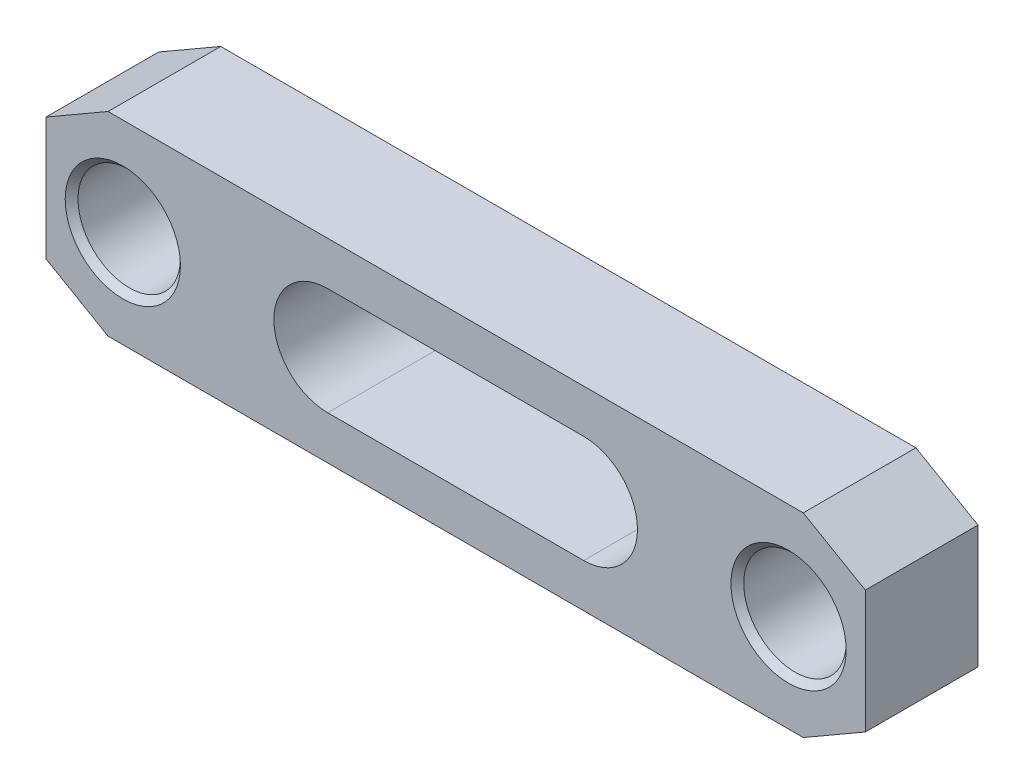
ISO-10303-21;
HEADER;
FILE_DESCRIPTION(('STEP AP214'),'2;1');
FILE_NAME('part.step','',(''),(''),'','','');
FILE_SCHEMA(('AUTOMOTIVE_DESIGN { 1 0 10303 214 1 1 1 1 }'));
ENDSEC;
DATA;
#1=APPLICATION_CONTEXT('core data for automotive mechanical design processes');
#2=APPLICATION_PROTOCOL_DEFINITION('international standard','automotive_design',2000,#1);
#3=PRODUCT_CONTEXT('',#1,'mechanical');
#4=PRODUCT('Part','Part','',(#3));
#5=PRODUCT_RELATED_PRODUCT_CATEGORY('part','',(#4));
#6=PRODUCT_DEFINITION_FORMATION('','',#4);
#7=PRODUCT_DEFINITION_CONTEXT('part definition',#1,'design');
#8=PRODUCT_DEFINITION('design','',#6,#7);
#9=PRODUCT_DEFINITION_SHAPE('','',#8);
#10=(LENGTH_UNIT() NAMED_UNIT(*) SI_UNIT(.MILLI.,.METRE.));
#11=(NAMED_UNIT(*) PLANE_ANGLE_UNIT() SI_UNIT($,.RADIAN.));
#12=(NAMED_UNIT(*) SI_UNIT($,.STERADIAN.) SOLID_ANGLE_UNIT());
#13=UNCERTAINTY_MEASURE_WITH_UNIT(LENGTH_MEASURE(1.E-05),#10,'distance_accuracy_value','');
#14=(GEOMETRIC_REPRESENTATION_CONTEXT(3) GLOBAL_UNCERTAINTY_ASSIGNED_CONTEXT((#13)) GLOBAL_UNIT_ASSIGNED_CONTEXT((#10,
#11,#12)) REPRESENTATION_CONTEXT('',''));
#15=CARTESIAN_POINT('',(0.,0.,0.));
#16=DIRECTION('',(0.,0.,1.));
#17=DIRECTION('',(1.,0.,0.));
#18=AXIS2_PLACEMENT_3D('',#15,#16,#17);
#19=CARTESIAN_POINT('',(80.,-19.,22.));
#20=DIRECTION('',(0.,0.,1.));
#21=DIRECTION('',(1.,0.,0.));
#22=AXIS2_PLACEMENT_3D('',#19,#20,#21);
#23=PLANE('',#22);
#24=CARTESIAN_POINT('',(65.,0.,22.));
#25=DIRECTION('',(0.,0.,-1.));
#26=DIRECTION('',(-1.,0.,0.));
#27=AXIS2_PLACEMENT_3D('',#24,#25,#26);
#28=CIRCLE('',#27,11.25);
#29=CARTESIAN_POINT('',(53.75,0.,22.));
#30=VERTEX_POINT('',#29);
#31=EDGE_CURVE('E212',#30,#30,#28,.T.);
#32=ORIENTED_EDGE('',*,*,#31,.T.);
#33=EDGE_LOOP('',(#32));
#34=FACE_BOUND('',#33,.T.);
#35=CARTESIAN_POINT('',(-65.,0.,22.));
#36=DIRECTION('',(0.,0.,-1.));
#37=DIRECTION('',(-1.,0.,0.));
#38=AXIS2_PLACEMENT_3D('',#35,#36,#37);
#39=CIRCLE('',#38,11.25);
#40=CARTESIAN_POINT('',(-76.25,0.,22.));
#41=VERTEX_POINT('',#40);
#42=EDGE_CURVE('E133',#41,#41,#39,.T.);
#43=ORIENTED_EDGE('',*,*,#42,.T.);
#44=EDGE_LOOP('',(#43));
#45=FACE_BOUND('',#44,.T.);
#46=DIRECTION('',(1.,0.,0.));
#47=VECTOR('',#46,1.);
#48=CARTESIAN_POINT('',(-67.875644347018,-19.,22.));
#49=LINE('',#48,#47);
#50=CARTESIAN_POINT('',(-67.875644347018,-19.,22.));
#51=VERTEX_POINT('',#50);
#52=CARTESIAN_POINT('',(67.875644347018,-19.,22.));
#53=VERTEX_POINT('',#52);
#54=EDGE_CURVE('E143',#51,#53,#49,.T.);
#55=ORIENTED_EDGE('',*,*,#54,.T.);
#56=DIRECTION('',(0.866025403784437,0.5,0.));
#57=VECTOR('',#56,1.);
#58=CARTESIAN_POINT('',(67.875644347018,-19.,22.));
#59=LINE('',#58,#57);
#60=CARTESIAN_POINT('',(80.,-12.,22.));
#61=VERTEX_POINT('',#60);
#62=EDGE_CURVE('E146',#53,#61,#59,.T.);
#63=ORIENTED_EDGE('',*,*,#62,.T.);
#64=DIRECTION('',(0.,1.,0.));
#65=VECTOR('',#64,1.);
#66=CARTESIAN_POINT('',(80.,-12.,22.));
#67=LINE('',#66,#65);
#68=CARTESIAN_POINT('',(80.,12.,22.));
#69=VERTEX_POINT('',#68);
#70=EDGE_CURVE('E149',#61,#69,#67,.T.);
#71=ORIENTED_EDGE('',*,*,#70,.T.);
#72=DIRECTION('',(-0.866025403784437,0.5,0.));
#73=VECTOR('',#72,1.);
#74=CARTESIAN_POINT('',(67.875644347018,19.,22.));
#75=LINE('',#74,#73);
#76=CARTESIAN_POINT('',(67.875644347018,19.,22.));
#77=VERTEX_POINT('',#76);
#78=EDGE_CURVE('E151',#69,#77,#75,.T.);
#79=ORIENTED_EDGE('',*,*,#78,.T.);
#80=DIRECTION('',(-1.,0.,0.));
#81=VECTOR('',#80,1.);
#82=CARTESIAN_POINT('',(-67.875644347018,19.,22.));
#83=LINE('',#82,#81);
#84=CARTESIAN_POINT('',(-67.875644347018,19.,22.));
#85=VERTEX_POINT('',#84);
#86=EDGE_CURVE('E153',#77,#85,#83,.T.);
#87=ORIENTED_EDGE('',*,*,#86,.T.);
#88=DIRECTION('',(-0.866025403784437,-0.5,0.));
#89=VECTOR('',#88,1.);
#90=CARTESIAN_POINT('',(-67.875644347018,19.,22.));
#91=LINE('',#90,#89);
#92=CARTESIAN_POINT('',(-80.,12.,22.));
#93=VERTEX_POINT('',#92);
#94=EDGE_CURVE('E155',#85,#93,#91,.T.);
#95=ORIENTED_EDGE('',*,*,#94,.T.);
#96=DIRECTION('',(0.,-1.,0.));
#97=VECTOR('',#96,1.);
#98=CARTESIAN_POINT('',(-80.,-12.,22.));
#99=LINE('',#98,#97);
#100=CARTESIAN_POINT('',(-80.,-12.,22.));
#101=VERTEX_POINT('',#100);
#102=EDGE_CURVE('E157',#93,#101,#99,.T.);
#103=ORIENTED_EDGE('',*,*,#102,.T.);
#104=DIRECTION('',(0.866025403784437,-0.5,0.));
#105=VECTOR('',#104,1.);
#106=CARTESIAN_POINT('',(-67.875644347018,-19.,22.));
#107=LINE('',#106,#105);
#108=EDGE_CURVE('E159',#101,#51,#107,.T.);
#109=ORIENTED_EDGE('',*,*,#108,.T.);
#110=EDGE_LOOP('',(#55,#63,#71,#79,#87,#95,#103,#109));
#111=FACE_BOUND('',#110,.T.);
#112=DIRECTION('',(-1.,0.,0.));
#113=VECTOR('',#112,1.);
#114=CARTESIAN_POINT('',(25.,10.5,22.));
#115=LINE('',#114,#113);
#116=CARTESIAN_POINT('',(25.,10.5,22.));
#117=VERTEX_POINT('',#116);
#118=CARTESIAN_POINT('',(-25.,10.5,22.));
#119=VERTEX_POINT('',#118);
#120=EDGE_CURVE('E113',#117,#119,#115,.T.);
#121=ORIENTED_EDGE('',*,*,#120,.F.);
#122=CARTESIAN_POINT('',(25.,0.,22.));
#123=DIRECTION('',(0.,0.,1.));
#124=DIRECTION('',(1.,0.,0.));
#125=AXIS2_PLACEMENT_3D('',#122,#123,#124);
#126=CIRCLE('',#125,10.5);
#127=CARTESIAN_POINT('',(25.,-10.5,22.));
#128=VERTEX_POINT('',#127);
#129=EDGE_CURVE('E105',#128,#117,#126,.T.);
#130=ORIENTED_EDGE('',*,*,#129,.F.);
#131=DIRECTION('',(1.,0.,0.));
#132=VECTOR('',#131,1.);
#133=CARTESIAN_POINT('',(25.,-10.5,22.));
#134=LINE('',#133,#132);
#135=CARTESIAN_POINT('',(-25.,-10.5,22.));
#136=VERTEX_POINT('',#135);
#137=EDGE_CURVE('E127',#136,#128,#134,.T.);
#138=ORIENTED_EDGE('',*,*,#137,.F.);
#139=CARTESIAN_POINT('',(-25.,0.,22.));
#140=DIRECTION('',(0.,0.,1.));
#141=DIRECTION('',(1.,0.,0.));
#142=AXIS2_PLACEMENT_3D('',#139,#140,#141);
#143=CIRCLE('',#142,10.5);
#144=EDGE_CURVE('E125',#119,#136,#143,.T.);
#145=ORIENTED_EDGE('',*,*,#144,.F.);
#146=EDGE_LOOP('',(#121,#130,#138,#145));
#147=FACE_BOUND('',#146,.T.);
#148=ADVANCED_FACE('F14',(#34,#45,#111,#147),#23,.T.);
#149=CARTESIAN_POINT('',(80.,-19.,0.));
#150=DIRECTION('',(0.,0.,1.));
#151=DIRECTION('',(1.,0.,0.));
#152=AXIS2_PLACEMENT_3D('',#149,#150,#151);
#153=PLANE('',#152);
#154=CARTESIAN_POINT('',(65.,0.,0.));
#155=DIRECTION('',(0.,0.,-1.));
#156=DIRECTION('',(-1.,0.,0.));
#157=AXIS2_PLACEMENT_3D('',#154,#155,#156);
#158=CIRCLE('',#157,11.25);
#159=CARTESIAN_POINT('',(53.75,0.,0.));
#160=VERTEX_POINT('',#159);
#161=EDGE_CURVE('E202',#160,#160,#158,.T.);
#162=ORIENTED_EDGE('',*,*,#161,.F.);
#163=EDGE_LOOP('',(#162));
#164=FACE_BOUND('',#163,.T.);
#165=CARTESIAN_POINT('',(-65.,0.,0.));
#166=DIRECTION('',(0.,0.,-1.));
#167=DIRECTION('',(-1.,0.,0.));
#168=AXIS2_PLACEMENT_3D('',#165,#166,#167);
#169=CIRCLE('',#168,11.25);
#170=CARTESIAN_POINT('',(-76.25,0.,0.));
#171=VERTEX_POINT('',#170);
#172=EDGE_CURVE('E215',#171,#171,#169,.T.);
#173=ORIENTED_EDGE('',*,*,#172,.F.);
#174=EDGE_LOOP('',(#173));
#175=FACE_BOUND('',#174,.T.);
#176=DIRECTION('',(1.,0.,0.));
#177=VECTOR('',#176,1.);
#178=CARTESIAN_POINT('',(-67.875644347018,-19.,0.));
#179=LINE('',#178,#177);
#180=CARTESIAN_POINT('',(-67.875644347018,-19.,0.));
#181=VERTEX_POINT('',#180);
#182=CARTESIAN_POINT('',(67.875644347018,-19.,0.));
#183=VERTEX_POINT('',#182);
#184=EDGE_CURVE('E121',#181,#183,#179,.T.);
#185=ORIENTED_EDGE('',*,*,#184,.F.);
#186=DIRECTION('',(0.866025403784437,-0.5,0.));
#187=VECTOR('',#186,1.);
#188=CARTESIAN_POINT('',(-67.875644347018,-19.,0.));
#189=LINE('',#188,#187);
#190=CARTESIAN_POINT('',(-80.,-12.,0.));
#191=VERTEX_POINT('',#190);
#192=EDGE_CURVE('E147',#191,#181,#189,.T.);
#193=ORIENTED_EDGE('',*,*,#192,.F.);
#194=DIRECTION('',(0.,-1.,0.));
#195=VECTOR('',#194,1.);
#196=CARTESIAN_POINT('',(-80.,-12.,0.));
#197=LINE('',#196,#195);
#198=CARTESIAN_POINT('',(-80.,12.,0.));
#199=VERTEX_POINT('',#198);
#200=EDGE_CURVE('E174',#199,#191,#197,.T.);
#201=ORIENTED_EDGE('',*,*,#200,.F.);
#202=DIRECTION('',(-0.866025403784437,-0.5,0.));
#203=VECTOR('',#202,1.);
#204=CARTESIAN_POINT('',(-67.875644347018,19.,0.));
#205=LINE('',#204,#203);
#206=CARTESIAN_POINT('',(-67.875644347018,19.,0.));
#207=VERTEX_POINT('',#206);
#208=EDGE_CURVE('E172',#207,#199,#205,.T.);
#209=ORIENTED_EDGE('',*,*,#208,.F.);
#210=DIRECTION('',(-1.,0.,0.));
#211=VECTOR('',#210,1.);
#212=CARTESIAN_POINT('',(-67.875644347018,19.,0.));
#213=LINE('',#212,#211);
#214=CARTESIAN_POINT('',(67.875644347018,19.,0.));
#215=VERTEX_POINT('',#214);
#216=EDGE_CURVE('E170',#215,#207,#213,.T.);
#217=ORIENTED_EDGE('',*,*,#216,.F.);
#218=DIRECTION('',(-0.866025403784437,0.5,0.));
#219=VECTOR('',#218,1.);
#220=CARTESIAN_POINT('',(67.875644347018,19.,0.));
#221=LINE('',#220,#219);
#222=CARTESIAN_POINT('',(80.,12.,0.));
#223=VERTEX_POINT('',#222);
#224=EDGE_CURVE('E168',#223,#215,#221,.T.);
#225=ORIENTED_EDGE('',*,*,#224,.F.);
#226=DIRECTION('',(0.,1.,0.));
#227=VECTOR('',#226,1.);
#228=CARTESIAN_POINT('',(80.,-12.,0.));
#229=LINE('',#228,#227);
#230=CARTESIAN_POINT('',(80.,-12.,0.));
#231=VERTEX_POINT('',#230);
#232=EDGE_CURVE('E166',#231,#223,#229,.T.);
#233=ORIENTED_EDGE('',*,*,#232,.F.);
#234=DIRECTION('',(0.866025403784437,0.5,0.));
#235=VECTOR('',#234,1.);
#236=CARTESIAN_POINT('',(67.875644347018,-19.,0.));
#237=LINE('',#236,#235);
#238=EDGE_CURVE('E164',#183,#231,#237,.T.);
#239=ORIENTED_EDGE('',*,*,#238,.F.);
#240=EDGE_LOOP('',(#185,#193,#201,#209,#217,#225,#233,#239));
#241=FACE_BOUND('',#240,.T.);
#242=CARTESIAN_POINT('',(25.,0.,0.));
#243=DIRECTION('',(0.,0.,1.));
#244=DIRECTION('',(1.,0.,0.));
#245=AXIS2_PLACEMENT_3D('',#242,#243,#244);
#246=CIRCLE('',#245,10.5);
#247=CARTESIAN_POINT('',(25.,-10.5,0.));
#248=VERTEX_POINT('',#247);
#249=CARTESIAN_POINT('',(25.,10.5,0.));
#250=VERTEX_POINT('',#249);
#251=EDGE_CURVE('E39',#248,#250,#246,.T.);
#252=ORIENTED_EDGE('',*,*,#251,.T.);
#253=DIRECTION('',(-1.,0.,0.));
#254=VECTOR('',#253,1.);
#255=CARTESIAN_POINT('',(25.,10.5,0.));
#256=LINE('',#255,#254);
#257=CARTESIAN_POINT('',(-25.,10.5,0.));
#258=VERTEX_POINT('',#257);
#259=EDGE_CURVE('E120',#250,#258,#256,.T.);
#260=ORIENTED_EDGE('',*,*,#259,.T.);
#261=CARTESIAN_POINT('',(-25.,0.,0.));
#262=DIRECTION('',(0.,0.,1.));
#263=DIRECTION('',(1.,0.,0.));
#264=AXIS2_PLACEMENT_3D('',#261,#262,#263);
#265=CIRCLE('',#264,10.5);
#266=CARTESIAN_POINT('',(-25.,-10.5,0.));
#267=VERTEX_POINT('',#266);
#268=EDGE_CURVE('E135',#258,#267,#265,.T.);
#269=ORIENTED_EDGE('',*,*,#268,.T.);
#270=DIRECTION('',(1.,0.,0.));
#271=VECTOR('',#270,1.);
#272=CARTESIAN_POINT('',(25.,-10.5,0.));
#273=LINE('',#272,#271);
#274=EDGE_CURVE('E114',#267,#248,#273,.T.);
#275=ORIENTED_EDGE('',*,*,#274,.T.);
#276=EDGE_LOOP('',(#252,#260,#269,#275));
#277=FACE_BOUND('',#276,.T.);
#278=ADVANCED_FACE('F238',(#164,#175,#241,#277),#153,.F.);
#279=CARTESIAN_POINT('',(-67.875644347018,-19.,22.));
#280=DIRECTION('',(0.,1.,0.));
#281=DIRECTION('',(-1.,0.,0.));
#282=AXIS2_PLACEMENT_3D('',#279,#280,#281);
#283=PLANE('',#282);
#284=ORIENTED_EDGE('',*,*,#184,.T.);
#285=DIRECTION('',(0.,0.,-1.));
#286=VECTOR('',#285,1.);
#287=CARTESIAN_POINT('',(67.875644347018,-19.,22.));
#288=LINE('',#287,#286);
#289=EDGE_CURVE('E9',#53,#183,#288,.T.);
#290=ORIENTED_EDGE('',*,*,#289,.F.);
#291=ORIENTED_EDGE('',*,*,#54,.F.);
#292=DIRECTION('',(0.,0.,-1.));
#293=VECTOR('',#292,1.);
#294=CARTESIAN_POINT('',(-67.875644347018,-19.,22.));
#295=LINE('',#294,#293);
#296=EDGE_CURVE('E161',#51,#181,#295,.T.);
#297=ORIENTED_EDGE('',*,*,#296,.T.);
#298=EDGE_LOOP('',(#284,#290,#291,#297));
#299=FACE_BOUND('',#298,.T.);
#300=ADVANCED_FACE('F16',(#299),#283,.F.);
#301=CARTESIAN_POINT('',(67.875644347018,-19.,22.));
#302=DIRECTION('',(-0.5,0.866025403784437,0.));
#303=DIRECTION('',(-0.866025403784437,-0.5,0.));
#304=AXIS2_PLACEMENT_3D('',#301,#302,#303);
#305=PLANE('',#304);
#306=ORIENTED_EDGE('',*,*,#238,.T.);
#307=DIRECTION('',(0.,0.,-1.));
#308=VECTOR('',#307,1.);
#309=CARTESIAN_POINT('',(80.,-12.,22.));
#310=LINE('',#309,#308);
#311=EDGE_CURVE('E23',#61,#231,#310,.T.);
#312=ORIENTED_EDGE('',*,*,#311,.F.);
#313=ORIENTED_EDGE('',*,*,#62,.F.);
#314=ORIENTED_EDGE('',*,*,#289,.T.);
#315=EDGE_LOOP('',(#306,#312,#313,#314));
#316=FACE_BOUND('',#315,.T.);
#317=ADVANCED_FACE('F271',(#316),#305,.F.);
#318=CARTESIAN_POINT('',(80.,-12.,22.));
#319=DIRECTION('',(-1.,0.,0.));
#320=DIRECTION('',(0.,0.,1.));
#321=AXIS2_PLACEMENT_3D('',#318,#319,#320);
#322=PLANE('',#321);
#323=ORIENTED_EDGE('',*,*,#232,.T.);
#324=DIRECTION('',(0.,0.,-1.));
#325=VECTOR('',#324,1.);
#326=CARTESIAN_POINT('',(80.,12.,22.));
#327=LINE('',#326,#325);
#328=EDGE_CURVE('E191',#69,#223,#327,.T.);
#329=ORIENTED_EDGE('',*,*,#328,.F.);
#330=ORIENTED_EDGE('',*,*,#70,.F.);
#331=ORIENTED_EDGE('',*,*,#311,.T.);
#332=EDGE_LOOP('',(#323,#329,#330,#331));
#333=FACE_BOUND('',#332,.T.);
#334=ADVANCED_FACE('F268',(#333),#322,.F.);
#335=CARTESIAN_POINT('',(67.875644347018,19.,22.));
#336=DIRECTION('',(-0.5,-0.866025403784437,0.));
#337=DIRECTION('',(0.866025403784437,-0.5,0.));
#338=AXIS2_PLACEMENT_3D('',#335,#336,#337);
#339=PLANE('',#338);
#340=ORIENTED_EDGE('',*,*,#224,.T.);
#341=DIRECTION('',(0.,0.,-1.));
#342=VECTOR('',#341,1.);
#343=CARTESIAN_POINT('',(67.875644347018,19.,22.));
#344=LINE('',#343,#342);
#345=EDGE_CURVE('E188',#77,#215,#344,.T.);
#346=ORIENTED_EDGE('',*,*,#345,.F.);
#347=ORIENTED_EDGE('',*,*,#78,.F.);
#348=ORIENTED_EDGE('',*,*,#328,.T.);
#349=EDGE_LOOP('',(#340,#346,#347,#348));
#350=FACE_BOUND('',#349,.T.);
#351=ADVANCED_FACE('F264',(#350),#339,.F.);
#352=CARTESIAN_POINT('',(-67.875644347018,19.,22.));
#353=DIRECTION('',(0.,-1.,0.));
#354=DIRECTION('',(0.,0.,-1.));
#355=AXIS2_PLACEMENT_3D('',#352,#353,#354);
#356=PLANE('',#355);
#357=ORIENTED_EDGE('',*,*,#216,.T.);
#358=DIRECTION('',(0.,0.,-1.));
#359=VECTOR('',#358,1.);
#360=CARTESIAN_POINT('',(-67.875644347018,19.,22.));
#361=LINE('',#360,#359);
#362=EDGE_CURVE('E185',#85,#207,#361,.T.);
#363=ORIENTED_EDGE('',*,*,#362,.F.);
#364=ORIENTED_EDGE('',*,*,#86,.F.);
#365=ORIENTED_EDGE('',*,*,#345,.T.);
#366=EDGE_LOOP('',(#357,#363,#364,#365));
#367=FACE_BOUND('',#366,.T.);
#368=ADVANCED_FACE('F260',(#367),#356,.F.);
#369=CARTESIAN_POINT('',(-67.875644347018,19.,22.));
#370=DIRECTION('',(0.5,-0.866025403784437,0.));
#371=DIRECTION('',(0.866025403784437,0.5,0.));
#372=AXIS2_PLACEMENT_3D('',#369,#370,#371);
#373=PLANE('',#372);
#374=ORIENTED_EDGE('',*,*,#208,.T.);
#375=DIRECTION('',(0.,0.,-1.));
#376=VECTOR('',#375,1.);
#377=CARTESIAN_POINT('',(-80.,12.,22.));
#378=LINE('',#377,#376);
#379=EDGE_CURVE('E182',#93,#199,#378,.T.);
#380=ORIENTED_EDGE('',*,*,#379,.F.);
#381=ORIENTED_EDGE('',*,*,#94,.F.);
#382=ORIENTED_EDGE('',*,*,#362,.T.);
#383=EDGE_LOOP('',(#374,#380,#381,#382));
#384=FACE_BOUND('',#383,.T.);
#385=ADVANCED_FACE('F256',(#384),#373,.F.);
#386=CARTESIAN_POINT('',(-80.,-12.,22.));
#387=DIRECTION('',(1.,0.,0.));
#388=DIRECTION('',(0.,0.,-1.));
#389=AXIS2_PLACEMENT_3D('',#386,#387,#388);
#390=PLANE('',#389);
#391=ORIENTED_EDGE('',*,*,#200,.T.);
#392=DIRECTION('',(0.,0.,-1.));
#393=VECTOR('',#392,1.);
#394=CARTESIAN_POINT('',(-80.,-12.,22.));
#395=LINE('',#394,#393);
#396=EDGE_CURVE('E179',#101,#191,#395,.T.);
#397=ORIENTED_EDGE('',*,*,#396,.F.);
#398=ORIENTED_EDGE('',*,*,#102,.F.);
#399=ORIENTED_EDGE('',*,*,#379,.T.);
#400=EDGE_LOOP('',(#391,#397,#398,#399));
#401=FACE_BOUND('',#400,.T.);
#402=ADVANCED_FACE('F252',(#401),#390,.F.);
#403=CARTESIAN_POINT('',(-67.875644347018,-19.,22.));
#404=DIRECTION('',(0.5,0.866025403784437,0.));
#405=DIRECTION('',(-0.866025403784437,0.5,0.));
#406=AXIS2_PLACEMENT_3D('',#403,#404,#405);
#407=PLANE('',#406);
#408=ORIENTED_EDGE('',*,*,#192,.T.);
#409=ORIENTED_EDGE('',*,*,#296,.F.);
#410=ORIENTED_EDGE('',*,*,#108,.F.);
#411=ORIENTED_EDGE('',*,*,#396,.T.);
#412=EDGE_LOOP('',(#408,#409,#410,#411));
#413=FACE_BOUND('',#412,.T.);
#414=ADVANCED_FACE('F249',(#413),#407,.F.);
#415=CARTESIAN_POINT('',(25.,0.,22.));
#416=DIRECTION('',(0.,0.,-1.));
#417=DIRECTION('',(-1.,0.,0.));
#418=AXIS2_PLACEMENT_3D('',#415,#416,#417);
#419=CYLINDRICAL_SURFACE('',#418,10.5);
#420=ORIENTED_EDGE('',*,*,#251,.F.);
#421=DIRECTION('',(0.,0.,-1.));
#422=VECTOR('',#421,1.);
#423=CARTESIAN_POINT('',(25.,-10.5,22.));
#424=LINE('',#423,#422);
#425=EDGE_CURVE('E109',#128,#248,#424,.T.);
#426=ORIENTED_EDGE('',*,*,#425,.F.);
#427=ORIENTED_EDGE('',*,*,#129,.T.);
#428=DIRECTION('',(0.,0.,-1.));
#429=VECTOR('',#428,1.);
#430=CARTESIAN_POINT('',(25.,10.5,22.));
#431=LINE('',#430,#429);
#432=EDGE_CURVE('E108',#117,#250,#431,.T.);
#433=ORIENTED_EDGE('',*,*,#432,.T.);
#434=EDGE_LOOP('',(#420,#426,#427,#433));
#435=FACE_BOUND('',#434,.T.);
#436=ADVANCED_FACE('F107',(#435),#419,.F.);
#437=CARTESIAN_POINT('',(25.,10.5,22.));
#438=DIRECTION('',(0.,-1.,0.));
#439=DIRECTION('',(1.,0.,0.));
#440=AXIS2_PLACEMENT_3D('',#437,#438,#439);
#441=PLANE('',#440);
#442=ORIENTED_EDGE('',*,*,#259,.F.);
#443=ORIENTED_EDGE('',*,*,#432,.F.);
#444=ORIENTED_EDGE('',*,*,#120,.T.);
#445=DIRECTION('',(0.,0.,-1.));
#446=VECTOR('',#445,1.);
#447=CARTESIAN_POINT('',(-25.,10.5,22.));
#448=LINE('',#447,#446);
#449=EDGE_CURVE('E122',#119,#258,#448,.T.);
#450=ORIENTED_EDGE('',*,*,#449,.T.);
#451=EDGE_LOOP('',(#442,#443,#444,#450));
#452=FACE_BOUND('',#451,.T.);
#453=ADVANCED_FACE('F117',(#452),#441,.T.);
#454=CARTESIAN_POINT('',(-25.,0.,22.));
#455=DIRECTION('',(0.,0.,-1.));
#456=DIRECTION('',(-1.,0.,0.));
#457=AXIS2_PLACEMENT_3D('',#454,#455,#456);
#458=CYLINDRICAL_SURFACE('',#457,10.5);
#459=ORIENTED_EDGE('',*,*,#268,.F.);
#460=ORIENTED_EDGE('',*,*,#449,.F.);
#461=ORIENTED_EDGE('',*,*,#144,.T.);
#462=DIRECTION('',(0.,0.,-1.));
#463=VECTOR('',#462,1.);
#464=CARTESIAN_POINT('',(-25.,-10.5,22.));
#465=LINE('',#464,#463);
#466=EDGE_CURVE('E31',#136,#267,#465,.T.);
#467=ORIENTED_EDGE('',*,*,#466,.T.);
#468=EDGE_LOOP('',(#459,#460,#461,#467));
#469=FACE_BOUND('',#468,.T.);
#470=ADVANCED_FACE('F235',(#469),#458,.F.);
#471=CARTESIAN_POINT('',(25.,-10.5,22.));
#472=DIRECTION('',(0.,1.,0.));
#473=DIRECTION('',(-1.,0.,0.));
#474=AXIS2_PLACEMENT_3D('',#471,#472,#473);
#475=PLANE('',#474);
#476=ORIENTED_EDGE('',*,*,#274,.F.);
#477=ORIENTED_EDGE('',*,*,#466,.F.);
#478=ORIENTED_EDGE('',*,*,#137,.T.);
#479=ORIENTED_EDGE('',*,*,#425,.T.);
#480=EDGE_LOOP('',(#476,#477,#478,#479));
#481=FACE_BOUND('',#480,.T.);
#482=ADVANCED_FACE('F225',(#481),#475,.T.);
#483=CARTESIAN_POINT('',(-65.,0.,19.5));
#484=DIRECTION('',(0.,0.,1.));
#485=DIRECTION('',(1.,0.,0.));
#486=AXIS2_PLACEMENT_3D('',#483,#484,#485);
#487=CONICAL_SURFACE('',#486,8.75,0.785398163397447);
#488=CARTESIAN_POINT('',(-65.,0.,20.75));
#489=DIRECTION('',(0.,0.,1.));
#490=DIRECTION('',(1.,0.,0.));
#491=AXIS2_PLACEMENT_3D('',#488,#489,#490);
#492=CIRCLE('',#491,10.);
#493=CARTESIAN_POINT('',(-55.,0.,20.75));
#494=VERTEX_POINT('',#493);
#495=EDGE_CURVE('E197',#494,#494,#492,.F.);
#496=ORIENTED_EDGE('',*,*,#495,.T.);
#497=EDGE_LOOP('',(#496));
#498=FACE_BOUND('',#497,.T.);
#499=ORIENTED_EDGE('',*,*,#42,.F.);
#500=EDGE_LOOP('',(#499));
#501=FACE_BOUND('',#500,.T.);
#502=ADVANCED_FACE('F222',(#498,#501),#487,.F.);
#503=CARTESIAN_POINT('',(-65.,0.,0.));
#504=DIRECTION('',(0.,0.,-1.));
#505=DIRECTION('',(-1.,0.,0.));
#506=AXIS2_PLACEMENT_3D('',#503,#504,#505);
#507=CONICAL_SURFACE('',#506,11.25,0.785398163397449);
#508=CARTESIAN_POINT('',(-65.,0.,1.25));
#509=DIRECTION('',(0.,0.,-1.));
#510=DIRECTION('',(-1.,0.,0.));
#511=AXIS2_PLACEMENT_3D('',#508,#509,#510);
#512=CIRCLE('',#511,10.);
#513=CARTESIAN_POINT('',(-75.,0.,1.25));
#514=VERTEX_POINT('',#513);
#515=EDGE_CURVE('E195',#514,#514,#512,.F.);
#516=ORIENTED_EDGE('',*,*,#515,.T.);
#517=EDGE_LOOP('',(#516));
#518=FACE_BOUND('',#517,.T.);
#519=ORIENTED_EDGE('',*,*,#172,.T.);
#520=EDGE_LOOP('',(#519));
#521=FACE_BOUND('',#520,.T.);
#522=ADVANCED_FACE('F224',(#518,#521),#507,.F.);
#523=CARTESIAN_POINT('',(65.,0.,19.5));
#524=DIRECTION('',(0.,0.,1.));
#525=DIRECTION('',(1.,0.,0.));
#526=AXIS2_PLACEMENT_3D('',#523,#524,#525);
#527=CONICAL_SURFACE('',#526,8.75,0.785398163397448);
#528=CARTESIAN_POINT('',(65.,0.,20.75));
#529=DIRECTION('',(0.,0.,1.));
#530=DIRECTION('',(1.,0.,0.));
#531=AXIS2_PLACEMENT_3D('',#528,#529,#530);
#532=CIRCLE('',#531,10.);
#533=CARTESIAN_POINT('',(75.,0.,20.75));
#534=VERTEX_POINT('',#533);
#535=EDGE_CURVE('E198',#534,#534,#532,.F.);
#536=ORIENTED_EDGE('',*,*,#535,.T.);
#537=EDGE_LOOP('',(#536));
#538=FACE_BOUND('',#537,.T.);
#539=ORIENTED_EDGE('',*,*,#31,.F.);
#540=EDGE_LOOP('',(#539));
#541=FACE_BOUND('',#540,.T.);
#542=ADVANCED_FACE('F233',(#538,#541),#527,.F.);
#543=CARTESIAN_POINT('',(65.,0.,0.));
#544=DIRECTION('',(0.,0.,-1.));
#545=DIRECTION('',(-1.,0.,0.));
#546=AXIS2_PLACEMENT_3D('',#543,#544,#545);
#547=CONICAL_SURFACE('',#546,11.25,0.785398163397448);
#548=CARTESIAN_POINT('',(65.,0.,1.25));
#549=DIRECTION('',(0.,0.,-1.));
#550=DIRECTION('',(-1.,0.,0.));
#551=AXIS2_PLACEMENT_3D('',#548,#549,#550);
#552=CIRCLE('',#551,10.);
#553=CARTESIAN_POINT('',(55.,0.,1.25));
#554=VERTEX_POINT('',#553);
#555=EDGE_CURVE('E18',#554,#554,#552,.F.);
#556=ORIENTED_EDGE('',*,*,#555,.T.);
#557=EDGE_LOOP('',(#556));
#558=FACE_BOUND('',#557,.T.);
#559=ORIENTED_EDGE('',*,*,#161,.T.);
#560=EDGE_LOOP('',(#559));
#561=FACE_BOUND('',#560,.T.);
#562=ADVANCED_FACE('F398',(#558,#561),#547,.F.);
#563=CARTESIAN_POINT('',(-65.,0.,0.));
#564=DIRECTION('',(0.,0.,1.));
#565=DIRECTION('',(1.,0.,0.));
#566=AXIS2_PLACEMENT_3D('',#563,#564,#565);
#567=CYLINDRICAL_SURFACE('',#566,10.);
#568=ORIENTED_EDGE('',*,*,#515,.F.);
#569=EDGE_LOOP('',(#568));
#570=FACE_BOUND('',#569,.T.);
#571=ORIENTED_EDGE('',*,*,#495,.F.);
#572=EDGE_LOOP('',(#571));
#573=FACE_BOUND('',#572,.T.);
#574=ADVANCED_FACE('F407',(#570,#573),#567,.F.);
#575=CARTESIAN_POINT('',(65.,0.,0.));
#576=DIRECTION('',(0.,0.,1.));
#577=DIRECTION('',(1.,0.,0.));
#578=AXIS2_PLACEMENT_3D('',#575,#576,#577);
#579=CYLINDRICAL_SURFACE('',#578,10.);
#580=ORIENTED_EDGE('',*,*,#555,.F.);
#581=EDGE_LOOP('',(#580));
#582=FACE_BOUND('',#581,.T.);
#583=ORIENTED_EDGE('',*,*,#535,.F.);
#584=EDGE_LOOP('',(#583));
#585=FACE_BOUND('',#584,.T.);
#586=ADVANCED_FACE('F417',(#582,#585),#579,.F.);
#587=CLOSED_SHELL('',(#148,#278,#300,#317,#334,#351,#368,#385,#402,#414,#436,#453,#470,#482,
#502,#522,#542,#562,#574,#586));
#588=MANIFOLD_SOLID_BREP('B1',#587);
#589=ADVANCED_BREP_SHAPE_REPRESENTATION('',(#18,#588),#14);
#590=SHAPE_DEFINITION_REPRESENTATION(#9,#589);
ENDSEC;
END-ISO-10303-21;
